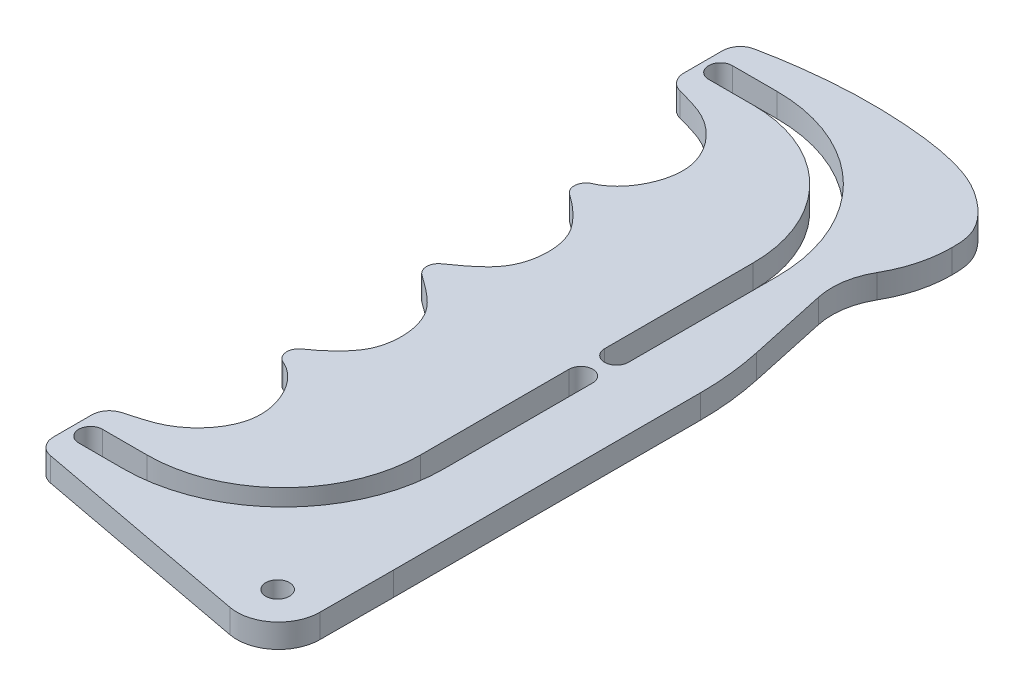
ISO-10303-21;
HEADER;
FILE_DESCRIPTION(('STEP AP214'),'2;1');
FILE_NAME('part.step','',(''),(''),'','','');
FILE_SCHEMA(('AUTOMOTIVE_DESIGN { 1 0 10303 214 1 1 1 1 }'));
ENDSEC;
DATA;
#1=APPLICATION_CONTEXT('core data for automotive mechanical design processes');
#2=APPLICATION_PROTOCOL_DEFINITION('international standard','automotive_design',2000,#1);
#3=PRODUCT_CONTEXT('',#1,'mechanical');
#4=PRODUCT('Part','Part','',(#3));
#5=PRODUCT_RELATED_PRODUCT_CATEGORY('part','',(#4));
#6=PRODUCT_DEFINITION_FORMATION('','',#4);
#7=PRODUCT_DEFINITION_CONTEXT('part definition',#1,'design');
#8=PRODUCT_DEFINITION('design','',#6,#7);
#9=PRODUCT_DEFINITION_SHAPE('','',#8);
#10=(LENGTH_UNIT() NAMED_UNIT(*) SI_UNIT(.MILLI.,.METRE.));
#11=(NAMED_UNIT(*) PLANE_ANGLE_UNIT() SI_UNIT($,.RADIAN.));
#12=(NAMED_UNIT(*) SI_UNIT($,.STERADIAN.) SOLID_ANGLE_UNIT());
#13=UNCERTAINTY_MEASURE_WITH_UNIT(LENGTH_MEASURE(1.E-05),#10,'distance_accuracy_value','');
#14=(GEOMETRIC_REPRESENTATION_CONTEXT(3) GLOBAL_UNCERTAINTY_ASSIGNED_CONTEXT((#13)) GLOBAL_UNIT_ASSIGNED_CONTEXT((#10,
#11,#12)) REPRESENTATION_CONTEXT('',''));
#15=CARTESIAN_POINT('',(0.,0.,0.));
#16=DIRECTION('',(0.,0.,1.));
#17=DIRECTION('',(1.,0.,0.));
#18=AXIS2_PLACEMENT_3D('',#15,#16,#17);
#19=CARTESIAN_POINT('',(0.,2.,-3.));
#20=DIRECTION('',(0.,-1.,0.));
#21=DIRECTION('',(0.,0.,-1.));
#22=AXIS2_PLACEMENT_3D('',#19,#20,#21);
#23=CYLINDRICAL_SURFACE('',#22,2.);
#24=CARTESIAN_POINT('',(0.,-2.,-3.));
#25=DIRECTION('',(0.,1.,0.));
#26=DIRECTION('',(0.,0.,1.));
#27=AXIS2_PLACEMENT_3D('',#24,#25,#26);
#28=CIRCLE('',#27,2.);
#29=CARTESIAN_POINT('',(-2.,-2.,-3.));
#30=VERTEX_POINT('',#29);
#31=CARTESIAN_POINT('',(2.,-2.,-3.));
#32=VERTEX_POINT('',#31);
#33=EDGE_CURVE('E450',#30,#32,#28,.T.);
#34=ORIENTED_EDGE('',*,*,#33,.F.);
#35=DIRECTION('',(0.,-1.,0.));
#36=VECTOR('',#35,1.);
#37=CARTESIAN_POINT('',(-2.,2.,-3.));
#38=LINE('',#37,#36);
#39=CARTESIAN_POINT('',(-2.,2.,-3.));
#40=VERTEX_POINT('',#39);
#41=EDGE_CURVE('E319',#40,#30,#38,.T.);
#42=ORIENTED_EDGE('',*,*,#41,.F.);
#43=CARTESIAN_POINT('',(0.,2.,-3.));
#44=DIRECTION('',(0.,1.,0.));
#45=DIRECTION('',(0.,0.,1.));
#46=AXIS2_PLACEMENT_3D('',#43,#44,#45);
#47=CIRCLE('',#46,2.);
#48=CARTESIAN_POINT('',(2.,2.,-3.));
#49=VERTEX_POINT('',#48);
#50=EDGE_CURVE('E675',#40,#49,#47,.T.);
#51=ORIENTED_EDGE('',*,*,#50,.T.);
#52=DIRECTION('',(0.,-1.,0.));
#53=VECTOR('',#52,1.);
#54=CARTESIAN_POINT('',(2.,2.,-3.));
#55=LINE('',#54,#53);
#56=EDGE_CURVE('E473',#49,#32,#55,.T.);
#57=ORIENTED_EDGE('',*,*,#56,.T.);
#58=EDGE_LOOP('',(#34,#42,#51,#57));
#59=FACE_BOUND('',#58,.T.);
#60=ADVANCED_FACE('F34',(#59),#23,.F.);
#61=CARTESIAN_POINT('',(-2.,2.,0.));
#62=DIRECTION('',(1.,0.,0.));
#63=DIRECTION('',(0.,0.,-1.));
#64=AXIS2_PLACEMENT_3D('',#61,#62,#63);
#65=PLANE('',#64);
#66=DIRECTION('',(0.,0.,1.));
#67=VECTOR('',#66,1.);
#68=CARTESIAN_POINT('',(-2.,-2.,0.));
#69=LINE('',#68,#67);
#70=CARTESIAN_POINT('',(-2.,-2.,-28.));
#71=VERTEX_POINT('',#70);
#72=EDGE_CURVE('E453',#71,#30,#69,.T.);
#73=ORIENTED_EDGE('',*,*,#72,.F.);
#74=DIRECTION('',(0.,-1.,0.));
#75=VECTOR('',#74,1.);
#76=CARTESIAN_POINT('',(-2.,2.,-28.));
#77=LINE('',#76,#75);
#78=CARTESIAN_POINT('',(-2.,2.,-28.));
#79=VERTEX_POINT('',#78);
#80=EDGE_CURVE('E488',#79,#71,#77,.T.);
#81=ORIENTED_EDGE('',*,*,#80,.F.);
#82=DIRECTION('',(0.,0.,1.));
#83=VECTOR('',#82,1.);
#84=CARTESIAN_POINT('',(-2.,2.,0.));
#85=LINE('',#84,#83);
#86=EDGE_CURVE('E678',#79,#40,#85,.T.);
#87=ORIENTED_EDGE('',*,*,#86,.T.);
#88=ORIENTED_EDGE('',*,*,#41,.T.);
#89=EDGE_LOOP('',(#73,#81,#87,#88));
#90=FACE_BOUND('',#89,.T.);
#91=ADVANCED_FACE('F575',(#90),#65,.T.);
#92=CARTESIAN_POINT('',(-25.,2.,-28.));
#93=DIRECTION('',(0.,-1.,0.));
#94=DIRECTION('',(0.,0.,-1.));
#95=AXIS2_PLACEMENT_3D('',#92,#93,#94);
#96=CYLINDRICAL_SURFACE('',#95,23.);
#97=CARTESIAN_POINT('',(-25.,-2.,-28.));
#98=DIRECTION('',(0.,1.,0.));
#99=DIRECTION('',(0.,0.,1.));
#100=AXIS2_PLACEMENT_3D('',#97,#98,#99);
#101=CIRCLE('',#100,23.);
#102=CARTESIAN_POINT('',(-25.,-2.,-51.));
#103=VERTEX_POINT('',#102);
#104=EDGE_CURVE('E456',#103,#71,#101,.F.);
#105=ORIENTED_EDGE('',*,*,#104,.F.);
#106=DIRECTION('',(0.,-1.,0.));
#107=VECTOR('',#106,1.);
#108=CARTESIAN_POINT('',(-25.,2.,-51.));
#109=LINE('',#108,#107);
#110=CARTESIAN_POINT('',(-25.,2.,-51.));
#111=VERTEX_POINT('',#110);
#112=EDGE_CURVE('E486',#111,#103,#109,.T.);
#113=ORIENTED_EDGE('',*,*,#112,.F.);
#114=CARTESIAN_POINT('',(-25.,2.,-28.));
#115=DIRECTION('',(0.,1.,0.));
#116=DIRECTION('',(0.,0.,1.));
#117=AXIS2_PLACEMENT_3D('',#114,#115,#116);
#118=CIRCLE('',#117,23.);
#119=EDGE_CURVE('E681',#111,#79,#118,.F.);
#120=ORIENTED_EDGE('',*,*,#119,.T.);
#121=ORIENTED_EDGE('',*,*,#80,.T.);
#122=EDGE_LOOP('',(#105,#113,#120,#121));
#123=FACE_BOUND('',#122,.T.);
#124=ADVANCED_FACE('F581',(#123),#96,.T.);
#125=CARTESIAN_POINT('',(0.,2.,-51.));
#126=DIRECTION('',(0.,0.,-1.));
#127=DIRECTION('',(-1.,0.,0.));
#128=AXIS2_PLACEMENT_3D('',#125,#126,#127);
#129=PLANE('',#128);
#130=DIRECTION('',(1.,0.,0.));
#131=VECTOR('',#130,1.);
#132=CARTESIAN_POINT('',(0.,-2.,-51.));
#133=LINE('',#132,#131);
#134=CARTESIAN_POINT('',(-32.5,-2.,-51.));
#135=VERTEX_POINT('',#134);
#136=EDGE_CURVE('E459',#135,#103,#133,.T.);
#137=ORIENTED_EDGE('',*,*,#136,.F.);
#138=DIRECTION('',(0.,-1.,0.));
#139=VECTOR('',#138,1.);
#140=CARTESIAN_POINT('',(-32.5,2.,-51.));
#141=LINE('',#140,#139);
#142=CARTESIAN_POINT('',(-32.5,2.,-51.));
#143=VERTEX_POINT('',#142);
#144=EDGE_CURVE('E484',#143,#135,#141,.T.);
#145=ORIENTED_EDGE('',*,*,#144,.F.);
#146=DIRECTION('',(1.,0.,0.));
#147=VECTOR('',#146,1.);
#148=CARTESIAN_POINT('',(0.,2.,-51.));
#149=LINE('',#148,#147);
#150=EDGE_CURVE('E684',#143,#111,#149,.T.);
#151=ORIENTED_EDGE('',*,*,#150,.T.);
#152=ORIENTED_EDGE('',*,*,#112,.T.);
#153=EDGE_LOOP('',(#137,#145,#151,#152));
#154=FACE_BOUND('',#153,.T.);
#155=ADVANCED_FACE('F709',(#154),#129,.T.);
#156=CARTESIAN_POINT('',(-32.5,2.,-53.));
#157=DIRECTION('',(0.,-1.,0.));
#158=DIRECTION('',(0.,0.,-1.));
#159=AXIS2_PLACEMENT_3D('',#156,#157,#158);
#160=CYLINDRICAL_SURFACE('',#159,2.);
#161=CARTESIAN_POINT('',(-32.5,-2.,-53.));
#162=DIRECTION('',(0.,1.,0.));
#163=DIRECTION('',(0.,0.,1.));
#164=AXIS2_PLACEMENT_3D('',#161,#162,#163);
#165=CIRCLE('',#164,2.);
#166=CARTESIAN_POINT('',(-32.5,-2.,-55.));
#167=VERTEX_POINT('',#166);
#168=EDGE_CURVE('E462',#167,#135,#165,.T.);
#169=ORIENTED_EDGE('',*,*,#168,.F.);
#170=DIRECTION('',(0.,-1.,0.));
#171=VECTOR('',#170,1.);
#172=CARTESIAN_POINT('',(-32.5,2.,-55.));
#173=LINE('',#172,#171);
#174=CARTESIAN_POINT('',(-32.5,2.,-55.));
#175=VERTEX_POINT('',#174);
#176=EDGE_CURVE('E482',#175,#167,#173,.T.);
#177=ORIENTED_EDGE('',*,*,#176,.F.);
#178=CARTESIAN_POINT('',(-32.5,2.,-53.));
#179=DIRECTION('',(0.,1.,0.));
#180=DIRECTION('',(0.,0.,1.));
#181=AXIS2_PLACEMENT_3D('',#178,#179,#180);
#182=CIRCLE('',#181,2.);
#183=EDGE_CURVE('E687',#175,#143,#182,.T.);
#184=ORIENTED_EDGE('',*,*,#183,.T.);
#185=ORIENTED_EDGE('',*,*,#144,.T.);
#186=EDGE_LOOP('',(#169,#177,#184,#185));
#187=FACE_BOUND('',#186,.T.);
#188=ADVANCED_FACE('F713',(#187),#160,.F.);
#189=CARTESIAN_POINT('',(0.,2.,-55.));
#190=DIRECTION('',(0.,0.,-1.));
#191=DIRECTION('',(-1.,0.,0.));
#192=AXIS2_PLACEMENT_3D('',#189,#190,#191);
#193=PLANE('',#192);
#194=DIRECTION('',(1.,0.,0.));
#195=VECTOR('',#194,1.);
#196=CARTESIAN_POINT('',(0.,-2.,-55.));
#197=LINE('',#196,#195);
#198=CARTESIAN_POINT('',(-25.,-2.,-55.));
#199=VERTEX_POINT('',#198);
#200=EDGE_CURVE('E465',#167,#199,#197,.T.);
#201=ORIENTED_EDGE('',*,*,#200,.T.);
#202=DIRECTION('',(0.,-1.,0.));
#203=VECTOR('',#202,1.);
#204=CARTESIAN_POINT('',(-25.,2.,-55.));
#205=LINE('',#204,#203);
#206=CARTESIAN_POINT('',(-25.,2.,-55.));
#207=VERTEX_POINT('',#206);
#208=EDGE_CURVE('E479',#207,#199,#205,.T.);
#209=ORIENTED_EDGE('',*,*,#208,.F.);
#210=DIRECTION('',(1.,0.,0.));
#211=VECTOR('',#210,1.);
#212=CARTESIAN_POINT('',(0.,2.,-55.));
#213=LINE('',#212,#211);
#214=EDGE_CURVE('E690',#175,#207,#213,.T.);
#215=ORIENTED_EDGE('',*,*,#214,.F.);
#216=ORIENTED_EDGE('',*,*,#176,.T.);
#217=EDGE_LOOP('',(#201,#209,#215,#216));
#218=FACE_BOUND('',#217,.T.);
#219=ADVANCED_FACE('F718',(#218),#193,.F.);
#220=CARTESIAN_POINT('',(-25.,2.,-28.));
#221=DIRECTION('',(0.,-1.,0.));
#222=DIRECTION('',(0.,0.,-1.));
#223=AXIS2_PLACEMENT_3D('',#220,#221,#222);
#224=CYLINDRICAL_SURFACE('',#223,27.);
#225=CARTESIAN_POINT('',(-25.,-2.,-28.));
#226=DIRECTION('',(0.,1.,0.));
#227=DIRECTION('',(0.,0.,1.));
#228=AXIS2_PLACEMENT_3D('',#225,#226,#227);
#229=CIRCLE('',#228,27.);
#230=CARTESIAN_POINT('',(2.,-2.,-28.));
#231=VERTEX_POINT('',#230);
#232=EDGE_CURVE('E468',#199,#231,#229,.F.);
#233=ORIENTED_EDGE('',*,*,#232,.T.);
#234=DIRECTION('',(0.,-1.,0.));
#235=VECTOR('',#234,1.);
#236=CARTESIAN_POINT('',(2.,2.,-28.));
#237=LINE('',#236,#235);
#238=CARTESIAN_POINT('',(2.,2.,-28.));
#239=VERTEX_POINT('',#238);
#240=EDGE_CURVE('E475',#239,#231,#237,.T.);
#241=ORIENTED_EDGE('',*,*,#240,.F.);
#242=CARTESIAN_POINT('',(-25.,2.,-28.));
#243=DIRECTION('',(0.,1.,0.));
#244=DIRECTION('',(0.,0.,1.));
#245=AXIS2_PLACEMENT_3D('',#242,#243,#244);
#246=CIRCLE('',#245,27.);
#247=EDGE_CURVE('E693',#207,#239,#246,.F.);
#248=ORIENTED_EDGE('',*,*,#247,.F.);
#249=ORIENTED_EDGE('',*,*,#208,.T.);
#250=EDGE_LOOP('',(#233,#241,#248,#249));
#251=FACE_BOUND('',#250,.T.);
#252=ADVANCED_FACE('F620',(#251),#224,.F.);
#253=CARTESIAN_POINT('',(-25.,2.,28.));
#254=DIRECTION('',(0.,-1.,0.));
#255=DIRECTION('',(0.,0.,-1.));
#256=AXIS2_PLACEMENT_3D('',#253,#254,#255);
#257=CYLINDRICAL_SURFACE('',#256,27.);
#258=CARTESIAN_POINT('',(-25.,-2.,28.));
#259=DIRECTION('',(0.,1.,0.));
#260=DIRECTION('',(0.,0.,1.));
#261=AXIS2_PLACEMENT_3D('',#258,#259,#260);
#262=CIRCLE('',#261,27.);
#263=CARTESIAN_POINT('',(-25.,-2.,55.));
#264=VERTEX_POINT('',#263);
#265=CARTESIAN_POINT('',(2.,-2.,28.));
#266=VERTEX_POINT('',#265);
#267=EDGE_CURVE('E426',#264,#266,#262,.T.);
#268=ORIENTED_EDGE('',*,*,#267,.F.);
#269=DIRECTION('',(0.,-1.,0.));
#270=VECTOR('',#269,1.);
#271=CARTESIAN_POINT('',(-25.,2.,55.));
#272=LINE('',#271,#270);
#273=CARTESIAN_POINT('',(-25.,2.,55.));
#274=VERTEX_POINT('',#273);
#275=EDGE_CURVE('E476',#274,#264,#272,.T.);
#276=ORIENTED_EDGE('',*,*,#275,.F.);
#277=CARTESIAN_POINT('',(-25.,2.,28.));
#278=DIRECTION('',(0.,1.,0.));
#279=DIRECTION('',(0.,0.,1.));
#280=AXIS2_PLACEMENT_3D('',#277,#278,#279);
#281=CIRCLE('',#280,27.);
#282=CARTESIAN_POINT('',(2.,2.,28.));
#283=VERTEX_POINT('',#282);
#284=EDGE_CURVE('E652',#274,#283,#281,.T.);
#285=ORIENTED_EDGE('',*,*,#284,.T.);
#286=DIRECTION('',(0.,-1.,0.));
#287=VECTOR('',#286,1.);
#288=CARTESIAN_POINT('',(2.,2.,28.));
#289=LINE('',#288,#287);
#290=EDGE_CURVE('E307',#283,#266,#289,.T.);
#291=ORIENTED_EDGE('',*,*,#290,.T.);
#292=EDGE_LOOP('',(#268,#276,#285,#291));
#293=FACE_BOUND('',#292,.T.);
#294=ADVANCED_FACE('F616',(#293),#257,.F.);
#295=CARTESIAN_POINT('',(0.,2.,55.));
#296=DIRECTION('',(0.,0.,-1.));
#297=DIRECTION('',(-1.,0.,0.));
#298=AXIS2_PLACEMENT_3D('',#295,#296,#297);
#299=PLANE('',#298);
#300=DIRECTION('',(1.,0.,0.));
#301=VECTOR('',#300,1.);
#302=CARTESIAN_POINT('',(0.,-2.,55.));
#303=LINE('',#302,#301);
#304=CARTESIAN_POINT('',(-32.5,-2.,55.));
#305=VERTEX_POINT('',#304);
#306=EDGE_CURVE('E429',#305,#264,#303,.T.);
#307=ORIENTED_EDGE('',*,*,#306,.F.);
#308=DIRECTION('',(0.,-1.,0.));
#309=VECTOR('',#308,1.);
#310=CARTESIAN_POINT('',(-32.5,2.,55.));
#311=LINE('',#310,#309);
#312=CARTESIAN_POINT('',(-32.5,2.,55.));
#313=VERTEX_POINT('',#312);
#314=EDGE_CURVE('E504',#313,#305,#311,.T.);
#315=ORIENTED_EDGE('',*,*,#314,.F.);
#316=DIRECTION('',(1.,0.,0.));
#317=VECTOR('',#316,1.);
#318=CARTESIAN_POINT('',(0.,2.,55.));
#319=LINE('',#318,#317);
#320=EDGE_CURVE('E655',#313,#274,#319,.T.);
#321=ORIENTED_EDGE('',*,*,#320,.T.);
#322=ORIENTED_EDGE('',*,*,#275,.T.);
#323=EDGE_LOOP('',(#307,#315,#321,#322));
#324=FACE_BOUND('',#323,.T.);
#325=ADVANCED_FACE('F612',(#324),#299,.T.);
#326=CARTESIAN_POINT('',(-32.5,2.,53.));
#327=DIRECTION('',(0.,-1.,0.));
#328=DIRECTION('',(0.,0.,-1.));
#329=AXIS2_PLACEMENT_3D('',#326,#327,#328);
#330=CYLINDRICAL_SURFACE('',#329,2.);
#331=CARTESIAN_POINT('',(-32.5,-2.,53.));
#332=DIRECTION('',(0.,1.,0.));
#333=DIRECTION('',(0.,0.,1.));
#334=AXIS2_PLACEMENT_3D('',#331,#332,#333);
#335=CIRCLE('',#334,2.);
#336=CARTESIAN_POINT('',(-32.5,-2.,51.));
#337=VERTEX_POINT('',#336);
#338=EDGE_CURVE('E432',#305,#337,#335,.F.);
#339=ORIENTED_EDGE('',*,*,#338,.T.);
#340=DIRECTION('',(0.,-1.,0.));
#341=VECTOR('',#340,1.);
#342=CARTESIAN_POINT('',(-32.5,2.,51.));
#343=LINE('',#342,#341);
#344=CARTESIAN_POINT('',(-32.5,2.,51.));
#345=VERTEX_POINT('',#344);
#346=EDGE_CURVE('E501',#345,#337,#343,.T.);
#347=ORIENTED_EDGE('',*,*,#346,.F.);
#348=CARTESIAN_POINT('',(-32.5,2.,53.));
#349=DIRECTION('',(0.,1.,0.));
#350=DIRECTION('',(0.,0.,1.));
#351=AXIS2_PLACEMENT_3D('',#348,#349,#350);
#352=CIRCLE('',#351,2.);
#353=EDGE_CURVE('E658',#313,#345,#352,.F.);
#354=ORIENTED_EDGE('',*,*,#353,.F.);
#355=ORIENTED_EDGE('',*,*,#314,.T.);
#356=EDGE_LOOP('',(#339,#347,#354,#355));
#357=FACE_BOUND('',#356,.T.);
#358=ADVANCED_FACE('F608',(#357),#330,.F.);
#359=CARTESIAN_POINT('',(0.,2.,51.));
#360=DIRECTION('',(0.,0.,-1.));
#361=DIRECTION('',(-1.,0.,0.));
#362=AXIS2_PLACEMENT_3D('',#359,#360,#361);
#363=PLANE('',#362);
#364=DIRECTION('',(1.,0.,0.));
#365=VECTOR('',#364,1.);
#366=CARTESIAN_POINT('',(0.,-2.,51.));
#367=LINE('',#366,#365);
#368=CARTESIAN_POINT('',(-25.,-2.,51.));
#369=VERTEX_POINT('',#368);
#370=EDGE_CURVE('E435',#337,#369,#367,.T.);
#371=ORIENTED_EDGE('',*,*,#370,.T.);
#372=DIRECTION('',(0.,-1.,0.));
#373=VECTOR('',#372,1.);
#374=CARTESIAN_POINT('',(-25.,2.,51.));
#375=LINE('',#374,#373);
#376=CARTESIAN_POINT('',(-25.,2.,51.));
#377=VERTEX_POINT('',#376);
#378=EDGE_CURVE('E498',#377,#369,#375,.T.);
#379=ORIENTED_EDGE('',*,*,#378,.F.);
#380=DIRECTION('',(1.,0.,0.));
#381=VECTOR('',#380,1.);
#382=CARTESIAN_POINT('',(0.,2.,51.));
#383=LINE('',#382,#381);
#384=EDGE_CURVE('E661',#345,#377,#383,.T.);
#385=ORIENTED_EDGE('',*,*,#384,.F.);
#386=ORIENTED_EDGE('',*,*,#346,.T.);
#387=EDGE_LOOP('',(#371,#379,#385,#386));
#388=FACE_BOUND('',#387,.T.);
#389=ADVANCED_FACE('F604',(#388),#363,.F.);
#390=CARTESIAN_POINT('',(-25.,2.,28.));
#391=DIRECTION('',(0.,-1.,0.));
#392=DIRECTION('',(0.,0.,-1.));
#393=AXIS2_PLACEMENT_3D('',#390,#391,#392);
#394=CYLINDRICAL_SURFACE('',#393,23.);
#395=CARTESIAN_POINT('',(-25.,-2.,28.));
#396=DIRECTION('',(0.,1.,0.));
#397=DIRECTION('',(0.,0.,1.));
#398=AXIS2_PLACEMENT_3D('',#395,#396,#397);
#399=CIRCLE('',#398,23.);
#400=CARTESIAN_POINT('',(-2.,-2.,28.));
#401=VERTEX_POINT('',#400);
#402=EDGE_CURVE('E438',#369,#401,#399,.T.);
#403=ORIENTED_EDGE('',*,*,#402,.T.);
#404=DIRECTION('',(0.,-1.,0.));
#405=VECTOR('',#404,1.);
#406=CARTESIAN_POINT('',(-2.,2.,28.));
#407=LINE('',#406,#405);
#408=CARTESIAN_POINT('',(-2.,2.,28.));
#409=VERTEX_POINT('',#408);
#410=EDGE_CURVE('E495',#409,#401,#407,.T.);
#411=ORIENTED_EDGE('',*,*,#410,.F.);
#412=CARTESIAN_POINT('',(-25.,2.,28.));
#413=DIRECTION('',(0.,1.,0.));
#414=DIRECTION('',(0.,0.,1.));
#415=AXIS2_PLACEMENT_3D('',#412,#413,#414);
#416=CIRCLE('',#415,23.);
#417=EDGE_CURVE('E664',#377,#409,#416,.T.);
#418=ORIENTED_EDGE('',*,*,#417,.F.);
#419=ORIENTED_EDGE('',*,*,#378,.T.);
#420=EDGE_LOOP('',(#403,#411,#418,#419));
#421=FACE_BOUND('',#420,.T.);
#422=ADVANCED_FACE('F600',(#421),#394,.T.);
#423=CARTESIAN_POINT('',(-2.,2.,0.));
#424=DIRECTION('',(-1.,0.,0.));
#425=DIRECTION('',(0.,0.,1.));
#426=AXIS2_PLACEMENT_3D('',#423,#424,#425);
#427=PLANE('',#426);
#428=DIRECTION('',(0.,0.,-1.));
#429=VECTOR('',#428,1.);
#430=CARTESIAN_POINT('',(-2.,-2.,0.));
#431=LINE('',#430,#429);
#432=CARTESIAN_POINT('',(-2.,-2.,3.));
#433=VERTEX_POINT('',#432);
#434=EDGE_CURVE('E441',#401,#433,#431,.T.);
#435=ORIENTED_EDGE('',*,*,#434,.T.);
#436=DIRECTION('',(0.,-1.,0.));
#437=VECTOR('',#436,1.);
#438=CARTESIAN_POINT('',(-2.,2.,3.));
#439=LINE('',#438,#437);
#440=CARTESIAN_POINT('',(-2.,2.,3.));
#441=VERTEX_POINT('',#440);
#442=EDGE_CURVE('E492',#441,#433,#439,.T.);
#443=ORIENTED_EDGE('',*,*,#442,.F.);
#444=DIRECTION('',(0.,0.,-1.));
#445=VECTOR('',#444,1.);
#446=CARTESIAN_POINT('',(-2.,2.,0.));
#447=LINE('',#446,#445);
#448=EDGE_CURVE('E667',#409,#441,#447,.T.);
#449=ORIENTED_EDGE('',*,*,#448,.F.);
#450=ORIENTED_EDGE('',*,*,#410,.T.);
#451=EDGE_LOOP('',(#435,#443,#449,#450));
#452=FACE_BOUND('',#451,.T.);
#453=ADVANCED_FACE('F596',(#452),#427,.F.);
#454=CARTESIAN_POINT('',(0.,2.,3.));
#455=DIRECTION('',(0.,-1.,0.));
#456=DIRECTION('',(0.,0.,-1.));
#457=AXIS2_PLACEMENT_3D('',#454,#455,#456);
#458=CYLINDRICAL_SURFACE('',#457,2.);
#459=CARTESIAN_POINT('',(0.,-2.,3.));
#460=DIRECTION('',(0.,1.,0.));
#461=DIRECTION('',(0.,0.,1.));
#462=AXIS2_PLACEMENT_3D('',#459,#460,#461);
#463=CIRCLE('',#462,2.);
#464=CARTESIAN_POINT('',(2.,-2.,3.));
#465=VERTEX_POINT('',#464);
#466=EDGE_CURVE('E444',#433,#465,#463,.F.);
#467=ORIENTED_EDGE('',*,*,#466,.T.);
#468=DIRECTION('',(0.,-1.,0.));
#469=VECTOR('',#468,1.);
#470=CARTESIAN_POINT('',(2.,2.,3.));
#471=LINE('',#470,#469);
#472=CARTESIAN_POINT('',(2.,2.,3.));
#473=VERTEX_POINT('',#472);
#474=EDGE_CURVE('E309',#473,#465,#471,.T.);
#475=ORIENTED_EDGE('',*,*,#474,.F.);
#476=CARTESIAN_POINT('',(0.,2.,3.));
#477=DIRECTION('',(0.,1.,0.));
#478=DIRECTION('',(0.,0.,1.));
#479=AXIS2_PLACEMENT_3D('',#476,#477,#478);
#480=CIRCLE('',#479,2.);
#481=EDGE_CURVE('E670',#441,#473,#480,.F.);
#482=ORIENTED_EDGE('',*,*,#481,.F.);
#483=ORIENTED_EDGE('',*,*,#442,.T.);
#484=EDGE_LOOP('',(#467,#475,#482,#483));
#485=FACE_BOUND('',#484,.T.);
#486=ADVANCED_FACE('F593',(#485),#458,.F.);
#487=CARTESIAN_POINT('',(-11.9072006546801,2.,63.1953314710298));
#488=DIRECTION('',(0.185160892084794,0.,-0.982708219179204));
#489=DIRECTION('',(-0.982708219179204,0.,-0.185160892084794));
#490=AXIS2_PLACEMENT_3D('',#487,#488,#489);
#491=PLANE('',#490);
#492=DIRECTION('',(0.982708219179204,0.,0.185160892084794));
#493=VECTOR('',#492,1.);
#494=CARTESIAN_POINT('',(-11.9072006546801,2.,63.1953314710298));
#495=LINE('',#494,#493);
#496=CARTESIAN_POINT('',(-33.0554826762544,2.,59.2105934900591));
#497=VERTEX_POINT('',#496);
#498=CARTESIAN_POINT('',(4.1622015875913,2.,66.223112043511));
#499=VERTEX_POINT('',#498);
#500=EDGE_CURVE('E278',#497,#499,#495,.T.);
#501=ORIENTED_EDGE('',*,*,#500,.F.);
#502=DIRECTION('',(0.,-1.,0.));
#503=VECTOR('',#502,1.);
#504=CARTESIAN_POINT('',(-33.0554826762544,-2.,59.2105934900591));
#505=LINE('',#504,#503);
#506=CARTESIAN_POINT('',(-33.0554826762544,-2.,59.2105934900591));
#507=VERTEX_POINT('',#506);
#508=EDGE_CURVE('E325',#497,#507,#505,.T.);
#509=ORIENTED_EDGE('',*,*,#508,.T.);
#510=DIRECTION('',(0.982708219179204,0.,0.185160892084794));
#511=VECTOR('',#510,1.);
#512=CARTESIAN_POINT('',(-11.9072006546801,-2.,63.1953314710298));
#513=LINE('',#512,#511);
#514=CARTESIAN_POINT('',(4.1622015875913,-2.,66.223112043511));
#515=VERTEX_POINT('',#514);
#516=EDGE_CURVE('E305',#507,#515,#513,.T.);
#517=ORIENTED_EDGE('',*,*,#516,.T.);
#518=DIRECTION('',(0.,-1.,0.));
#519=VECTOR('',#518,1.);
#520=CARTESIAN_POINT('',(4.1622015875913,2.,66.223112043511));
#521=LINE('',#520,#519);
#522=EDGE_CURVE('E298',#499,#515,#521,.T.);
#523=ORIENTED_EDGE('',*,*,#522,.F.);
#524=EDGE_LOOP('',(#501,#509,#517,#523));
#525=FACE_BOUND('',#524,.T.);
#526=ADVANCED_FACE('F303',(#525),#491,.F.);
#527=CARTESIAN_POINT('',(5.45832783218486,2.,59.3441545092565));
#528=DIRECTION('',(0.,-1.,0.));
#529=DIRECTION('',(0.,0.,-1.));
#530=AXIS2_PLACEMENT_3D('',#527,#528,#529);
#531=CYLINDRICAL_SURFACE('',#530,7.);
#532=CARTESIAN_POINT('',(5.45832783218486,-2.,59.3441545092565));
#533=DIRECTION('',(0.,1.,0.));
#534=DIRECTION('',(0.,0.,1.));
#535=AXIS2_PLACEMENT_3D('',#532,#533,#534);
#536=CIRCLE('',#535,7.);
#537=CARTESIAN_POINT('',(12.4582880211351,-2.,59.3677628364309));
#538=VERTEX_POINT('',#537);
#539=EDGE_CURVE('E545',#515,#538,#536,.T.);
#540=ORIENTED_EDGE('',*,*,#539,.T.);
#541=DIRECTION('',(0.,-1.,0.));
#542=VECTOR('',#541,1.);
#543=CARTESIAN_POINT('',(12.4582880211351,2.,59.3677628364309));
#544=LINE('',#543,#542);
#545=CARTESIAN_POINT('',(12.4582880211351,2.,59.3677628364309));
#546=VERTEX_POINT('',#545);
#547=EDGE_CURVE('E299',#546,#538,#544,.T.);
#548=ORIENTED_EDGE('',*,*,#547,.F.);
#549=CARTESIAN_POINT('',(5.45832783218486,2.,59.3441545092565));
#550=DIRECTION('',(0.,1.,0.));
#551=DIRECTION('',(0.,0.,1.));
#552=AXIS2_PLACEMENT_3D('',#549,#550,#551);
#553=CIRCLE('',#552,7.);
#554=EDGE_CURVE('E284',#499,#546,#553,.T.);
#555=ORIENTED_EDGE('',*,*,#554,.F.);
#556=ORIENTED_EDGE('',*,*,#522,.T.);
#557=EDGE_LOOP('',(#540,#548,#555,#556));
#558=FACE_BOUND('',#557,.T.);
#559=ADVANCED_FACE('F297',(#558),#531,.T.);
#560=CARTESIAN_POINT('',(12.6583699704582,2.,0.0426920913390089));
#561=DIRECTION('',(0.999994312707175,0.,0.00337261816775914));
#562=DIRECTION('',(0.00337261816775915,0.,-0.999994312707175));
#563=AXIS2_PLACEMENT_3D('',#560,#561,#562);
#564=PLANE('',#563);
#565=DIRECTION('',(-0.00337261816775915,0.,0.999994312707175));
#566=VECTOR('',#565,1.);
#567=CARTESIAN_POINT('',(12.6583699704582,-2.,0.0426920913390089));
#568=LINE('',#567,#566);
#569=CARTESIAN_POINT('',(12.5,-2.,47.));
#570=VERTEX_POINT('',#569);
#571=EDGE_CURVE('E540',#570,#538,#568,.T.);
#572=ORIENTED_EDGE('',*,*,#571,.F.);
#573=DIRECTION('',(0.,-1.,0.));
#574=VECTOR('',#573,1.);
#575=CARTESIAN_POINT('',(12.5,2.,47.));
#576=LINE('',#575,#574);
#577=CARTESIAN_POINT('',(12.5,2.,47.));
#578=VERTEX_POINT('',#577);
#579=EDGE_CURVE('E311',#578,#570,#576,.T.);
#580=ORIENTED_EDGE('',*,*,#579,.F.);
#581=DIRECTION('',(-0.00337261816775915,0.,0.999994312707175));
#582=VECTOR('',#581,1.);
#583=CARTESIAN_POINT('',(12.6583699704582,2.,0.0426920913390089));
#584=LINE('',#583,#582);
#585=EDGE_CURVE('E301',#578,#546,#584,.T.);
#586=ORIENTED_EDGE('',*,*,#585,.T.);
#587=ORIENTED_EDGE('',*,*,#547,.T.);
#588=EDGE_LOOP('',(#572,#580,#586,#587));
#589=FACE_BOUND('',#588,.T.);
#590=ADVANCED_FACE('F544',(#589),#564,.T.);
#591=CARTESIAN_POINT('',(12.5,2.,0.));
#592=DIRECTION('',(-1.,0.,0.));
#593=DIRECTION('',(0.,0.,1.));
#594=AXIS2_PLACEMENT_3D('',#591,#592,#593);
#595=PLANE('',#594);
#596=DIRECTION('',(0.,0.,-1.));
#597=VECTOR('',#596,1.);
#598=CARTESIAN_POINT('',(12.5,-2.,0.));
#599=LINE('',#598,#597);
#600=CARTESIAN_POINT('',(12.5,-2.,-4.6535863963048));
#601=VERTEX_POINT('',#600);
#602=EDGE_CURVE('E533',#570,#601,#599,.T.);
#603=ORIENTED_EDGE('',*,*,#602,.T.);
#604=DIRECTION('',(0.,-1.,0.));
#605=VECTOR('',#604,1.);
#606=CARTESIAN_POINT('',(12.5,2.,-4.6535863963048));
#607=LINE('',#606,#605);
#608=CARTESIAN_POINT('',(12.5,2.,-4.6535863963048));
#609=VERTEX_POINT('',#608);
#610=EDGE_CURVE('E321',#601,#609,#607,.F.);
#611=ORIENTED_EDGE('',*,*,#610,.T.);
#612=DIRECTION('',(0.,0.,-1.));
#613=VECTOR('',#612,1.);
#614=CARTESIAN_POINT('',(12.5,2.,0.));
#615=LINE('',#614,#613);
#616=EDGE_CURVE('E536',#578,#609,#615,.T.);
#617=ORIENTED_EDGE('',*,*,#616,.F.);
#618=ORIENTED_EDGE('',*,*,#579,.T.);
#619=EDGE_LOOP('',(#603,#611,#617,#618));
#620=FACE_BOUND('',#619,.T.);
#621=ADVANCED_FACE('F532',(#620),#595,.F.);
#622=CARTESIAN_POINT('',(14.0077556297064,2.,-3.03029758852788));
#623=DIRECTION('',(0.977391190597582,0.,-0.21143902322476));
#624=DIRECTION('',(-0.21143902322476,0.,-0.977391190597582));
#625=AXIS2_PLACEMENT_3D('',#622,#623,#624);
#626=PLANE('',#625);
#627=DIRECTION('',(0.21143902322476,0.,0.977391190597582));
#628=VECTOR('',#627,1.);
#629=CARTESIAN_POINT('',(14.0077556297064,2.,-3.03029758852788));
#630=LINE('',#629,#628);
#631=CARTESIAN_POINT('',(8.5,2.,-28.4902706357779));
#632=VERTEX_POINT('',#631);
#633=CARTESIAN_POINT('',(11.3695595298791,2.,-15.2255375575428));
#634=VERTEX_POINT('',#633);
#635=EDGE_CURVE('E1017',#632,#634,#630,.T.);
#636=ORIENTED_EDGE('',*,*,#635,.T.);
#637=DIRECTION('',(0.,-1.,0.));
#638=VECTOR('',#637,1.);
#639=CARTESIAN_POINT('',(11.3695595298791,-2.,-15.2255375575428));
#640=LINE('',#639,#638);
#641=CARTESIAN_POINT('',(11.3695595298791,-2.,-15.2255375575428));
#642=VERTEX_POINT('',#641);
#643=EDGE_CURVE('E315',#634,#642,#640,.T.);
#644=ORIENTED_EDGE('',*,*,#643,.T.);
#645=DIRECTION('',(0.21143902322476,0.,0.977391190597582));
#646=VECTOR('',#645,1.);
#647=CARTESIAN_POINT('',(14.0077556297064,-2.,-3.03029758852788));
#648=LINE('',#647,#646);
#649=CARTESIAN_POINT('',(8.5,-2.,-28.4902706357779));
#650=VERTEX_POINT('',#649);
#651=EDGE_CURVE('E542',#650,#642,#648,.T.);
#652=ORIENTED_EDGE('',*,*,#651,.F.);
#653=DIRECTION('',(0.,-1.,0.));
#654=VECTOR('',#653,1.);
#655=CARTESIAN_POINT('',(8.5,2.,-28.4902706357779));
#656=LINE('',#655,#654);
#657=EDGE_CURVE('E527',#632,#650,#656,.T.);
#658=ORIENTED_EDGE('',*,*,#657,.F.);
#659=EDGE_LOOP('',(#636,#644,#652,#658));
#660=FACE_BOUND('',#659,.T.);
#661=ADVANCED_FACE('F818',(#660),#626,.T.);
#662=CARTESIAN_POINT('',(20.228694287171,2.,-31.027538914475));
#663=DIRECTION('',(0.,-1.,0.));
#664=DIRECTION('',(0.,0.,-1.));
#665=AXIS2_PLACEMENT_3D('',#662,#663,#664);
#666=CYLINDRICAL_SURFACE('',#665,12.);
#667=CARTESIAN_POINT('',(20.228694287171,-2.,-31.027538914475));
#668=DIRECTION('',(0.,1.,0.));
#669=DIRECTION('',(0.,0.,1.));
#670=AXIS2_PLACEMENT_3D('',#667,#668,#669);
#671=CIRCLE('',#670,12.);
#672=CARTESIAN_POINT('',(9.83043392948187,-2.,-37.0172118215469));
#673=VERTEX_POINT('',#672);
#674=EDGE_CURVE('E551',#673,#650,#671,.T.);
#675=ORIENTED_EDGE('',*,*,#674,.F.);
#676=DIRECTION('',(0.,-1.,0.));
#677=VECTOR('',#676,1.);
#678=CARTESIAN_POINT('',(9.83043392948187,2.,-37.0172118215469));
#679=LINE('',#678,#677);
#680=CARTESIAN_POINT('',(9.83043392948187,2.,-37.0172118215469));
#681=VERTEX_POINT('',#680);
#682=EDGE_CURVE('E525',#681,#673,#679,.T.);
#683=ORIENTED_EDGE('',*,*,#682,.F.);
#684=CARTESIAN_POINT('',(20.228694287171,2.,-31.027538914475));
#685=DIRECTION('',(0.,1.,0.));
#686=DIRECTION('',(0.,0.,1.));
#687=AXIS2_PLACEMENT_3D('',#684,#685,#686);
#688=CIRCLE('',#687,12.);
#689=EDGE_CURVE('E1014',#681,#632,#688,.T.);
#690=ORIENTED_EDGE('',*,*,#689,.T.);
#691=ORIENTED_EDGE('',*,*,#657,.T.);
#692=EDGE_LOOP('',(#675,#683,#690,#691));
#693=FACE_BOUND('',#692,.T.);
#694=ADVANCED_FACE('F826',(#693),#666,.F.);
#695=CARTESIAN_POINT('',(-7.5,2.,-47.));
#696=DIRECTION('',(0.,-1.,0.));
#697=DIRECTION('',(0.,0.,-1.));
#698=AXIS2_PLACEMENT_3D('',#695,#696,#697);
#699=CYLINDRICAL_SURFACE('',#698,20.);
#700=CARTESIAN_POINT('',(-7.5,-2.,-47.));
#701=DIRECTION('',(0.,1.,0.));
#702=DIRECTION('',(0.,0.,1.));
#703=AXIS2_PLACEMENT_3D('',#700,#701,#702);
#704=CIRCLE('',#703,20.);
#705=CARTESIAN_POINT('',(12.5,-2.,-47.));
#706=VERTEX_POINT('',#705);
#707=EDGE_CURVE('E554',#706,#673,#704,.F.);
#708=ORIENTED_EDGE('',*,*,#707,.F.);
#709=DIRECTION('',(0.,-1.,0.));
#710=VECTOR('',#709,1.);
#711=CARTESIAN_POINT('',(12.5,2.,-47.));
#712=LINE('',#711,#710);
#713=CARTESIAN_POINT('',(12.5,2.,-47.));
#714=VERTEX_POINT('',#713);
#715=EDGE_CURVE('E523',#714,#706,#712,.T.);
#716=ORIENTED_EDGE('',*,*,#715,.F.);
#717=CARTESIAN_POINT('',(-7.5,2.,-47.));
#718=DIRECTION('',(0.,1.,0.));
#719=DIRECTION('',(0.,0.,1.));
#720=AXIS2_PLACEMENT_3D('',#717,#718,#719);
#721=CIRCLE('',#720,20.);
#722=EDGE_CURVE('E965',#714,#681,#721,.F.);
#723=ORIENTED_EDGE('',*,*,#722,.T.);
#724=ORIENTED_EDGE('',*,*,#682,.T.);
#725=EDGE_LOOP('',(#708,#716,#723,#724));
#726=FACE_BOUND('',#725,.T.);
#727=ADVANCED_FACE('F833',(#726),#699,.T.);
#728=CARTESIAN_POINT('',(12.5,2.,-47.));
#729=CARTESIAN_POINT('',(12.5,2.,-48.4595926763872));
#730=CARTESIAN_POINT('',(12.1330337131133,2.,-52.066302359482));
#731=CARTESIAN_POINT('',(6.96442202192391,2.,-56.953390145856));
#732=CARTESIAN_POINT('',(0.391296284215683,2.,-59.8215146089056));
#733=CARTESIAN_POINT('',(-14.3841914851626,2.,-61.874265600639));
#734=CARTESIAN_POINT('',(-26.5753734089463,2.,-60.7817380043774));
#735=CARTESIAN_POINT('',(-35.5,2.,-58.75));
#736=B_SPLINE_CURVE_WITH_KNOTS('',3,(#728,#729,#730,#731,#732,#733,#734,#735),.UNSPECIFIED.,.F.,
.F.,(4,1,1,1,1,4),(0.,0.0608544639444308,0.194974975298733,0.322298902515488,0.525113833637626,
1.),.UNSPECIFIED.);
#737=DIRECTION('',(0.,-1.,0.));
#738=VECTOR('',#737,1.);
#739=SURFACE_OF_LINEAR_EXTRUSION('',#736,#738);
#740=CARTESIAN_POINT('',(12.5,-2.,-47.));
#741=CARTESIAN_POINT('',(12.5,-2.,-48.4595926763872));
#742=CARTESIAN_POINT('',(12.1330337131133,-2.,-52.066302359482));
#743=CARTESIAN_POINT('',(6.96442202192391,-2.,-56.953390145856));
#744=CARTESIAN_POINT('',(0.391296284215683,-2.,-59.8215146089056));
#745=CARTESIAN_POINT('',(-14.3841914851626,-2.,-61.874265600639));
#746=CARTESIAN_POINT('',(-26.5753734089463,-2.,-60.7817380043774));
#747=CARTESIAN_POINT('',(-35.5,-2.,-58.75));
#748=B_SPLINE_CURVE_WITH_KNOTS('',3,(#740,#741,#742,#743,#744,#745,#746,#747),.UNSPECIFIED.,.F.,
.F.,(4,1,1,1,1,4),(0.,0.0608544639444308,0.194974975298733,0.322298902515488,0.525113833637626,
1.),.UNSPECIFIED.);
#749=CARTESIAN_POINT('',(-33.0981626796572,-2.,-59.2679387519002));
#750=VERTEX_POINT('',#749);
#751=EDGE_CURVE('E384',#706,#750,#748,.T.);
#752=ORIENTED_EDGE('',*,*,#751,.T.);
#753=DIRECTION('',(0.,-1.,0.));
#754=VECTOR('',#753,1.);
#755=CARTESIAN_POINT('',(-33.0981626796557,-2.,-59.2679387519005));
#756=LINE('',#755,#754);
#757=CARTESIAN_POINT('',(-33.0981626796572,2.,-59.2679387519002));
#758=VERTEX_POINT('',#757);
#759=EDGE_CURVE('E11',#750,#758,#756,.F.);
#760=ORIENTED_EDGE('',*,*,#759,.T.);
#761=EDGE_CURVE('E365',#714,#758,#736,.T.);
#762=ORIENTED_EDGE('',*,*,#761,.F.);
#763=ORIENTED_EDGE('',*,*,#715,.T.);
#764=EDGE_LOOP('',(#752,#760,#762,#763));
#765=FACE_BOUND('',#764,.T.);
#766=ADVANCED_FACE('F565',(#765),#739,.F.);
#767=CARTESIAN_POINT('',(-35.5,2.,0.));
#768=DIRECTION('',(1.,0.,0.));
#769=DIRECTION('',(0.,0.,-1.));
#770=AXIS2_PLACEMENT_3D('',#767,#768,#769);
#771=PLANE('',#770);
#772=DIRECTION('',(0.,0.,1.));
#773=VECTOR('',#772,1.);
#774=CARTESIAN_POINT('',(-35.5,-2.,0.));
#775=LINE('',#774,#773);
#776=CARTESIAN_POINT('',(-35.5,-2.,-56.3281766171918));
#777=VERTEX_POINT('',#776);
#778=CARTESIAN_POINT('',(-35.5,-2.,-49.8346210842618));
#779=VERTEX_POINT('',#778);
#780=EDGE_CURVE('E360',#777,#779,#775,.T.);
#781=ORIENTED_EDGE('',*,*,#780,.T.);
#782=DIRECTION('',(0.,-1.,0.));
#783=VECTOR('',#782,1.);
#784=CARTESIAN_POINT('',(-35.5,2.,-49.8346210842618));
#785=LINE('',#784,#783);
#786=CARTESIAN_POINT('',(-35.5,2.,-49.8346210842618));
#787=VERTEX_POINT('',#786);
#788=EDGE_CURVE('E42',#779,#787,#785,.F.);
#789=ORIENTED_EDGE('',*,*,#788,.T.);
#790=DIRECTION('',(0.,0.,1.));
#791=VECTOR('',#790,1.);
#792=CARTESIAN_POINT('',(-35.5,2.,0.));
#793=LINE('',#792,#791);
#794=CARTESIAN_POINT('',(-35.5,2.,-56.3281766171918));
#795=VERTEX_POINT('',#794);
#796=EDGE_CURVE('E357',#795,#787,#793,.T.);
#797=ORIENTED_EDGE('',*,*,#796,.F.);
#798=DIRECTION('',(0.,-1.,0.));
#799=VECTOR('',#798,1.);
#800=CARTESIAN_POINT('',(-35.5,2.,-56.3281766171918));
#801=LINE('',#800,#799);
#802=EDGE_CURVE('E350',#795,#777,#801,.T.);
#803=ORIENTED_EDGE('',*,*,#802,.T.);
#804=EDGE_LOOP('',(#781,#789,#797,#803));
#805=FACE_BOUND('',#804,.T.);
#806=ADVANCED_FACE('F356',(#805),#771,.F.);
#807=CARTESIAN_POINT('',(-35.5,2.,-47.25));
#808=CARTESIAN_POINT('',(-34.3071179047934,2.,-47.25));
#809=CARTESIAN_POINT('',(-31.80546762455,2.,-46.5320161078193));
#810=CARTESIAN_POINT('',(-27.658461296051,2.,-45.3408874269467));
#811=CARTESIAN_POINT('',(-23.5174674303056,2.,-42.141088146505));
#812=CARTESIAN_POINT('',(-20.8192100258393,2.,-36.9422036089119));
#813=CARTESIAN_POINT('',(-22.0818570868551,2.,-29.9076725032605));
#814=CARTESIAN_POINT('',(-25.765807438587,2.,-25.8860325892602));
#815=CARTESIAN_POINT('',(-29.,2.,-25.5));
#816=B_SPLINE_CURVE_WITH_KNOTS('',3,(#807,#808,#809,#810,#811,#812,#813,#814,#815),
.UNSPECIFIED.,.F.,.F.,(4,1,1,1,1,1,4),(0.,0.107470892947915,0.228545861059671,0.385676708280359,
0.563597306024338,0.721103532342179,1.),.UNSPECIFIED.);
#817=DIRECTION('',(0.,-1.,0.));
#818=VECTOR('',#817,1.);
#819=SURFACE_OF_LINEAR_EXTRUSION('',#816,#818);
#820=CARTESIAN_POINT('',(-33.2259644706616,2.,-46.9237834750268));
#821=VERTEX_POINT('',#820);
#822=CARTESIAN_POINT('',(-27.0837669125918,2.,-26.0145453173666));
#823=VERTEX_POINT('',#822);
#824=EDGE_CURVE('E364',#821,#823,#816,.T.);
#825=ORIENTED_EDGE('',*,*,#824,.F.);
#826=DIRECTION('',(0.,-1.,0.));
#827=VECTOR('',#826,1.);
#828=CARTESIAN_POINT('',(-33.2259644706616,2.,-46.9237834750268));
#829=LINE('',#828,#827);
#830=CARTESIAN_POINT('',(-33.2259644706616,-2.,-46.9237834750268));
#831=VERTEX_POINT('',#830);
#832=EDGE_CURVE('E347',#821,#831,#829,.T.);
#833=ORIENTED_EDGE('',*,*,#832,.T.);
#834=CARTESIAN_POINT('',(-35.5,-2.,-47.25));
#835=CARTESIAN_POINT('',(-34.3071179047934,-2.,-47.25));
#836=CARTESIAN_POINT('',(-31.80546762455,-2.,-46.5320161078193));
#837=CARTESIAN_POINT('',(-27.658461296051,-2.,-45.3408874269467));
#838=CARTESIAN_POINT('',(-23.5174674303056,-2.,-42.141088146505));
#839=CARTESIAN_POINT('',(-20.8192100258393,-2.,-36.9422036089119));
#840=CARTESIAN_POINT('',(-22.0818570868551,-2.,-29.9076725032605));
#841=CARTESIAN_POINT('',(-25.765807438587,-2.,-25.8860325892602));
#842=CARTESIAN_POINT('',(-29.,-2.,-25.5));
#843=B_SPLINE_CURVE_WITH_KNOTS('',3,(#834,#835,#836,#837,#838,#839,#840,#841,#842),
.UNSPECIFIED.,.F.,.F.,(4,1,1,1,1,1,4),(0.,0.107470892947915,0.228545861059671,0.385676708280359,
0.563597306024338,0.721103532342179,1.),.UNSPECIFIED.);
#844=CARTESIAN_POINT('',(-27.0837669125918,-2.,-26.0145453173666));
#845=VERTEX_POINT('',#844);
#846=EDGE_CURVE('E373',#831,#845,#843,.T.);
#847=ORIENTED_EDGE('',*,*,#846,.T.);
#848=DIRECTION('',(0.,-1.,0.));
#849=VECTOR('',#848,1.);
#850=CARTESIAN_POINT('',(-27.0837669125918,2.,-26.0145453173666));
#851=LINE('',#850,#849);
#852=EDGE_CURVE('E521',#823,#845,#851,.T.);
#853=ORIENTED_EDGE('',*,*,#852,.F.);
#854=EDGE_LOOP('',(#825,#833,#847,#853));
#855=FACE_BOUND('',#854,.T.);
#856=ADVANCED_FACE('F371',(#855),#819,.F.);
#857=CARTESIAN_POINT('',(-26.2956601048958,2.,-24.1763702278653));
#858=DIRECTION('',(0.,-1.,0.));
#859=DIRECTION('',(0.,0.,-1.));
#860=AXIS2_PLACEMENT_3D('',#857,#858,#859);
#861=CYLINDRICAL_SURFACE('',#860,2.);
#862=CARTESIAN_POINT('',(-26.2956601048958,-2.,-24.1763702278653));
#863=DIRECTION('',(0.,1.,0.));
#864=DIRECTION('',(0.,0.,1.));
#865=AXIS2_PLACEMENT_3D('',#862,#863,#864);
#866=CIRCLE('',#865,2.);
#867=CARTESIAN_POINT('',(-27.4153423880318,-2.,-22.5191703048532));
#868=VERTEX_POINT('',#867);
#869=EDGE_CURVE('E380',#845,#868,#866,.T.);
#870=ORIENTED_EDGE('',*,*,#869,.T.);
#871=DIRECTION('',(0.,-1.,0.));
#872=VECTOR('',#871,1.);
#873=CARTESIAN_POINT('',(-27.4153423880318,2.,-22.5191703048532));
#874=LINE('',#873,#872);
#875=CARTESIAN_POINT('',(-27.4153423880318,2.,-22.5191703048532));
#876=VERTEX_POINT('',#875);
#877=EDGE_CURVE('E518',#876,#868,#874,.T.);
#878=ORIENTED_EDGE('',*,*,#877,.F.);
#879=CARTESIAN_POINT('',(-26.2956601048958,2.,-24.1763702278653));
#880=DIRECTION('',(0.,1.,0.));
#881=DIRECTION('',(0.,0.,1.));
#882=AXIS2_PLACEMENT_3D('',#879,#880,#881);
#883=CIRCLE('',#882,2.);
#884=EDGE_CURVE('E975',#823,#876,#883,.T.);
#885=ORIENTED_EDGE('',*,*,#884,.F.);
#886=ORIENTED_EDGE('',*,*,#852,.T.);
#887=EDGE_LOOP('',(#870,#878,#885,#886));
#888=FACE_BOUND('',#887,.T.);
#889=ADVANCED_FACE('F860',(#888),#861,.T.);
#890=CARTESIAN_POINT('',(-29.,2.,-23.5));
#891=CARTESIAN_POINT('',(-27.2923235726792,2.,-22.5339522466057));
#892=CARTESIAN_POINT('',(-24.630000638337,2.,-20.5558148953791));
#893=CARTESIAN_POINT('',(-21.4799221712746,2.,-16.913631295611));
#894=CARTESIAN_POINT('',(-20.4527694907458,2.,-12.0015635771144));
#895=CARTESIAN_POINT('',(-21.5767925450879,2.,-7.14950226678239));
#896=CARTESIAN_POINT('',(-25.2354928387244,2.,-3.61814026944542));
#897=CARTESIAN_POINT('',(-27.5739154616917,2.,-2.01104338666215));
#898=CARTESIAN_POINT('',(-29.,2.,-1.));
#899=B_SPLINE_CURVE_WITH_KNOTS('',3,(#890,#891,#892,#893,#894,#895,#896,#897,#898),
.UNSPECIFIED.,.F.,.F.,(4,1,1,1,1,1,4),(0.,0.201267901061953,0.344011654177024,0.483271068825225,
0.705793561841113,0.819971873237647,1.),.UNSPECIFIED.);
#900=DIRECTION('',(0.,-1.,0.));
#901=VECTOR('',#900,1.);
#902=SURFACE_OF_LINEAR_EXTRUSION('',#899,#901);
#903=CARTESIAN_POINT('',(-29.,-2.,-23.5));
#904=CARTESIAN_POINT('',(-27.2923235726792,-2.,-22.5339522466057));
#905=CARTESIAN_POINT('',(-24.630000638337,-2.,-20.5558148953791));
#906=CARTESIAN_POINT('',(-21.4799221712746,-2.,-16.913631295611));
#907=CARTESIAN_POINT('',(-20.4527694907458,-2.,-12.0015635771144));
#908=CARTESIAN_POINT('',(-21.5767925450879,-2.,-7.14950226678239));
#909=CARTESIAN_POINT('',(-25.2354928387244,-2.,-3.61814026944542));
#910=CARTESIAN_POINT('',(-27.5739154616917,-2.,-2.01104338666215));
#911=CARTESIAN_POINT('',(-29.,-2.,-1.));
#912=B_SPLINE_CURVE_WITH_KNOTS('',3,(#903,#904,#905,#906,#907,#908,#909,#910,#911),
.UNSPECIFIED.,.F.,.F.,(4,1,1,1,1,1,4),(0.,0.201267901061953,0.344011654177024,0.483271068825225,
0.705793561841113,0.819971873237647,1.),.UNSPECIFIED.);
#913=CARTESIAN_POINT('',(-28.1050819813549,-2.,-1.63267488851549));
#914=VERTEX_POINT('',#913);
#915=EDGE_CURVE('E382',#868,#914,#912,.T.);
#916=ORIENTED_EDGE('',*,*,#915,.T.);
#917=DIRECTION('',(0.,-1.,0.));
#918=VECTOR('',#917,1.);
#919=CARTESIAN_POINT('',(-28.1050819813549,2.,-1.63267488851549));
#920=LINE('',#919,#918);
#921=CARTESIAN_POINT('',(-28.1050819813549,2.,-1.63267488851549));
#922=VERTEX_POINT('',#921);
#923=EDGE_CURVE('E515',#922,#914,#920,.T.);
#924=ORIENTED_EDGE('',*,*,#923,.F.);
#925=EDGE_CURVE('E980',#876,#922,#899,.T.);
#926=ORIENTED_EDGE('',*,*,#925,.F.);
#927=ORIENTED_EDGE('',*,*,#877,.T.);
#928=EDGE_LOOP('',(#916,#924,#926,#927));
#929=FACE_BOUND('',#928,.T.);
#930=ADVANCED_FACE('F867',(#929),#902,.F.);
#931=CARTESIAN_POINT('',(-26.9499314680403,2.,0.));
#932=DIRECTION('',(0.,-1.,0.));
#933=DIRECTION('',(0.,0.,-1.));
#934=AXIS2_PLACEMENT_3D('',#931,#932,#933);
#935=CYLINDRICAL_SURFACE('',#934,2.);
#936=CARTESIAN_POINT('',(-26.9499314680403,-2.,0.));
#937=DIRECTION('',(0.,1.,0.));
#938=DIRECTION('',(0.,0.,1.));
#939=AXIS2_PLACEMENT_3D('',#936,#937,#938);
#940=CIRCLE('',#939,2.);
#941=CARTESIAN_POINT('',(-28.1050819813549,-2.,1.63267488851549));
#942=VERTEX_POINT('',#941);
#943=EDGE_CURVE('E396',#914,#942,#940,.T.);
#944=ORIENTED_EDGE('',*,*,#943,.T.);
#945=DIRECTION('',(0.,-1.,0.));
#946=VECTOR('',#945,1.);
#947=CARTESIAN_POINT('',(-28.1050819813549,2.,1.63267488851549));
#948=LINE('',#947,#946);
#949=CARTESIAN_POINT('',(-28.1050819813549,2.,1.63267488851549));
#950=VERTEX_POINT('',#949);
#951=EDGE_CURVE('E513',#950,#942,#948,.T.);
#952=ORIENTED_EDGE('',*,*,#951,.F.);
#953=CARTESIAN_POINT('',(-26.9499314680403,2.,0.));
#954=DIRECTION('',(0.,1.,0.));
#955=DIRECTION('',(0.,0.,1.));
#956=AXIS2_PLACEMENT_3D('',#953,#954,#955);
#957=CIRCLE('',#956,2.);
#958=EDGE_CURVE('E985',#922,#950,#957,.T.);
#959=ORIENTED_EDGE('',*,*,#958,.F.);
#960=ORIENTED_EDGE('',*,*,#923,.T.);
#961=EDGE_LOOP('',(#944,#952,#959,#960));
#962=FACE_BOUND('',#961,.T.);
#963=ADVANCED_FACE('F875',(#962),#935,.T.);
#964=CARTESIAN_POINT('',(-29.,2.,23.5));
#965=CARTESIAN_POINT('',(-27.2923235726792,2.,22.5339522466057));
#966=CARTESIAN_POINT('',(-24.630000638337,2.,20.5558148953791));
#967=CARTESIAN_POINT('',(-21.4799221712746,2.,16.913631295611));
#968=CARTESIAN_POINT('',(-20.4527694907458,2.,12.0015635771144));
#969=CARTESIAN_POINT('',(-21.5767925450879,2.,7.14950226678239));
#970=CARTESIAN_POINT('',(-25.2354928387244,2.,3.61814026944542));
#971=CARTESIAN_POINT('',(-27.5739154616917,2.,2.01104338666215));
#972=CARTESIAN_POINT('',(-29.,2.,1.));
#973=B_SPLINE_CURVE_WITH_KNOTS('',3,(#964,#965,#966,#967,#968,#969,#970,#971,#972),
.UNSPECIFIED.,.F.,.F.,(4,1,1,1,1,1,4),(0.,0.201267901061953,0.344011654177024,0.483271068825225,
0.705793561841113,0.819971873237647,1.),.UNSPECIFIED.);
#974=DIRECTION('',(0.,-1.,0.));
#975=VECTOR('',#974,1.);
#976=SURFACE_OF_LINEAR_EXTRUSION('',#973,#975);
#977=CARTESIAN_POINT('',(-29.,-2.,23.5));
#978=CARTESIAN_POINT('',(-27.2923235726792,-2.,22.5339522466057));
#979=CARTESIAN_POINT('',(-24.630000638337,-2.,20.5558148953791));
#980=CARTESIAN_POINT('',(-21.4799221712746,-2.,16.913631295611));
#981=CARTESIAN_POINT('',(-20.4527694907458,-2.,12.0015635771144));
#982=CARTESIAN_POINT('',(-21.5767925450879,-2.,7.14950226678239));
#983=CARTESIAN_POINT('',(-25.2354928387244,-2.,3.61814026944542));
#984=CARTESIAN_POINT('',(-27.5739154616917,-2.,2.01104338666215));
#985=CARTESIAN_POINT('',(-29.,-2.,1.));
#986=B_SPLINE_CURVE_WITH_KNOTS('',3,(#977,#978,#979,#980,#981,#982,#983,#984,#985),
.UNSPECIFIED.,.F.,.F.,(4,1,1,1,1,1,4),(0.,0.201267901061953,0.344011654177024,0.483271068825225,
0.705793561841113,0.819971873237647,1.),.UNSPECIFIED.);
#987=CARTESIAN_POINT('',(-27.4153423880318,-2.,22.5191703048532));
#988=VERTEX_POINT('',#987);
#989=EDGE_CURVE('E402',#988,#942,#986,.T.);
#990=ORIENTED_EDGE('',*,*,#989,.F.);
#991=DIRECTION('',(0.,-1.,0.));
#992=VECTOR('',#991,1.);
#993=CARTESIAN_POINT('',(-27.4153423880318,2.,22.5191703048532));
#994=LINE('',#993,#992);
#995=CARTESIAN_POINT('',(-27.4153423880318,2.,22.5191703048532));
#996=VERTEX_POINT('',#995);
#997=EDGE_CURVE('E510',#996,#988,#994,.T.);
#998=ORIENTED_EDGE('',*,*,#997,.F.);
#999=EDGE_CURVE('E989',#996,#950,#973,.T.);
#1000=ORIENTED_EDGE('',*,*,#999,.T.);
#1001=ORIENTED_EDGE('',*,*,#951,.T.);
#1002=EDGE_LOOP('',(#990,#998,#1000,#1001));
#1003=FACE_BOUND('',#1002,.T.);
#1004=ADVANCED_FACE('F883',(#1003),#976,.T.);
#1005=CARTESIAN_POINT('',(-26.2956601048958,2.,24.1763702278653));
#1006=DIRECTION('',(0.,-1.,0.));
#1007=DIRECTION('',(0.,0.,-1.));
#1008=AXIS2_PLACEMENT_3D('',#1005,#1006,#1007);
#1009=CYLINDRICAL_SURFACE('',#1008,2.);
#1010=CARTESIAN_POINT('',(-26.2956601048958,-2.,24.1763702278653));
#1011=DIRECTION('',(0.,1.,0.));
#1012=DIRECTION('',(0.,0.,1.));
#1013=AXIS2_PLACEMENT_3D('',#1010,#1011,#1012);
#1014=CIRCLE('',#1013,2.);
#1015=CARTESIAN_POINT('',(-27.0837669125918,-2.,26.0145453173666));
#1016=VERTEX_POINT('',#1015);
#1017=EDGE_CURVE('E407',#1016,#988,#1014,.F.);
#1018=ORIENTED_EDGE('',*,*,#1017,.F.);
#1019=DIRECTION('',(0.,-1.,0.));
#1020=VECTOR('',#1019,1.);
#1021=CARTESIAN_POINT('',(-27.0837669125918,2.,26.0145453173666));
#1022=LINE('',#1021,#1020);
#1023=CARTESIAN_POINT('',(-27.0837669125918,2.,26.0145453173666));
#1024=VERTEX_POINT('',#1023);
#1025=EDGE_CURVE('E507',#1024,#1016,#1022,.T.);
#1026=ORIENTED_EDGE('',*,*,#1025,.F.);
#1027=CARTESIAN_POINT('',(-26.2956601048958,2.,24.1763702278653));
#1028=DIRECTION('',(0.,1.,0.));
#1029=DIRECTION('',(0.,0.,1.));
#1030=AXIS2_PLACEMENT_3D('',#1027,#1028,#1029);
#1031=CIRCLE('',#1030,2.);
#1032=EDGE_CURVE('E642',#1024,#996,#1031,.F.);
#1033=ORIENTED_EDGE('',*,*,#1032,.T.);
#1034=ORIENTED_EDGE('',*,*,#997,.T.);
#1035=EDGE_LOOP('',(#1018,#1026,#1033,#1034));
#1036=FACE_BOUND('',#1035,.T.);
#1037=ADVANCED_FACE('F633',(#1036),#1009,.T.);
#1038=CARTESIAN_POINT('',(-35.5,2.,47.25));
#1039=CARTESIAN_POINT('',(-34.3071179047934,2.,47.25));
#1040=CARTESIAN_POINT('',(-31.80546762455,2.,46.5320161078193));
#1041=CARTESIAN_POINT('',(-27.658461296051,2.,45.3408874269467));
#1042=CARTESIAN_POINT('',(-23.5174674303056,2.,42.141088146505));
#1043=CARTESIAN_POINT('',(-20.8192100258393,2.,36.9422036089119));
#1044=CARTESIAN_POINT('',(-22.0818570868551,2.,29.9076725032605));
#1045=CARTESIAN_POINT('',(-25.765807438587,2.,25.8860325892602));
#1046=CARTESIAN_POINT('',(-29.,2.,25.5));
#1047=B_SPLINE_CURVE_WITH_KNOTS('',3,(#1038,#1039,#1040,#1041,#1042,#1043,#1044,#1045,#1046),
.UNSPECIFIED.,.F.,.F.,(4,1,1,1,1,1,4),(0.,0.107470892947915,0.228545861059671,0.385676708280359,
0.563597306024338,0.721103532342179,1.),.UNSPECIFIED.);
#1048=DIRECTION('',(0.,-1.,0.));
#1049=VECTOR('',#1048,1.);
#1050=SURFACE_OF_LINEAR_EXTRUSION('',#1047,#1049);
#1051=CARTESIAN_POINT('',(-35.5,-2.,47.25));
#1052=CARTESIAN_POINT('',(-34.3071179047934,-2.,47.25));
#1053=CARTESIAN_POINT('',(-31.80546762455,-2.,46.5320161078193));
#1054=CARTESIAN_POINT('',(-27.658461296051,-2.,45.3408874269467));
#1055=CARTESIAN_POINT('',(-23.5174674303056,-2.,42.141088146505));
#1056=CARTESIAN_POINT('',(-20.8192100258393,-2.,36.9422036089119));
#1057=CARTESIAN_POINT('',(-22.0818570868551,-2.,29.9076725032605));
#1058=CARTESIAN_POINT('',(-25.765807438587,-2.,25.8860325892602));
#1059=CARTESIAN_POINT('',(-29.,-2.,25.5));
#1060=B_SPLINE_CURVE_WITH_KNOTS('',3,(#1051,#1052,#1053,#1054,#1055,#1056,#1057,#1058,#1059),
.UNSPECIFIED.,.F.,.F.,(4,1,1,1,1,1,4),(0.,0.107470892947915,0.228545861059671,0.385676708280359,
0.563597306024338,0.721103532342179,1.),.UNSPECIFIED.);
#1061=CARTESIAN_POINT('',(-33.2259644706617,-2.,46.9237834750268));
#1062=VERTEX_POINT('',#1061);
#1063=EDGE_CURVE('E413',#1062,#1016,#1060,.T.);
#1064=ORIENTED_EDGE('',*,*,#1063,.F.);
#1065=DIRECTION('',(0.,-1.,0.));
#1066=VECTOR('',#1065,1.);
#1067=CARTESIAN_POINT('',(-33.2259644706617,-2.,46.9237834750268));
#1068=LINE('',#1067,#1066);
#1069=CARTESIAN_POINT('',(-33.2259644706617,2.,46.9237834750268));
#1070=VERTEX_POINT('',#1069);
#1071=EDGE_CURVE('E49',#1062,#1070,#1068,.F.);
#1072=ORIENTED_EDGE('',*,*,#1071,.T.);
#1073=EDGE_CURVE('E635',#1070,#1024,#1047,.T.);
#1074=ORIENTED_EDGE('',*,*,#1073,.T.);
#1075=ORIENTED_EDGE('',*,*,#1025,.T.);
#1076=EDGE_LOOP('',(#1064,#1072,#1074,#1075));
#1077=FACE_BOUND('',#1076,.T.);
#1078=ADVANCED_FACE('F591',(#1077),#1050,.T.);
#1079=CARTESIAN_POINT('',(2.,2.,0.));
#1080=DIRECTION('',(-1.,0.,0.));
#1081=DIRECTION('',(0.,0.,1.));
#1082=AXIS2_PLACEMENT_3D('',#1079,#1080,#1081);
#1083=PLANE('',#1082);
#1084=DIRECTION('',(0.,0.,-1.));
#1085=VECTOR('',#1084,1.);
#1086=CARTESIAN_POINT('',(2.,-2.,0.));
#1087=LINE('',#1086,#1085);
#1088=EDGE_CURVE('E447',#266,#465,#1087,.T.);
#1089=ORIENTED_EDGE('',*,*,#1088,.F.);
#1090=ORIENTED_EDGE('',*,*,#290,.F.);
#1091=DIRECTION('',(0.,0.,-1.));
#1092=VECTOR('',#1091,1.);
#1093=CARTESIAN_POINT('',(2.,2.,0.));
#1094=LINE('',#1093,#1092);
#1095=EDGE_CURVE('E672',#283,#473,#1094,.T.);
#1096=ORIENTED_EDGE('',*,*,#1095,.T.);
#1097=ORIENTED_EDGE('',*,*,#474,.T.);
#1098=EDGE_LOOP('',(#1089,#1090,#1096,#1097));
#1099=FACE_BOUND('',#1098,.T.);
#1100=ADVANCED_FACE('F587',(#1099),#1083,.T.);
#1101=CARTESIAN_POINT('',(5.58276338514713,2.,59.6110074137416));
#1102=DIRECTION('',(0.,-1.,0.));
#1103=DIRECTION('',(0.,0.,-1.));
#1104=AXIS2_PLACEMENT_3D('',#1101,#1102,#1103);
#1105=CYLINDRICAL_SURFACE('',#1104,2.);
#1106=CARTESIAN_POINT('',(5.58276338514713,2.,59.6110074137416));
#1107=DIRECTION('',(0.,1.,0.));
#1108=DIRECTION('',(0.,0.,1.));
#1109=AXIS2_PLACEMENT_3D('',#1106,#1107,#1108);
#1110=CIRCLE('',#1109,2.);
#1111=CARTESIAN_POINT('',(5.58276338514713,2.,61.6110074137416));
#1112=VERTEX_POINT('',#1111);
#1113=EDGE_CURVE('E649',#1112,#1112,#1110,.T.);
#1114=ORIENTED_EDGE('',*,*,#1113,.T.);
#1115=EDGE_LOOP('',(#1114));
#1116=FACE_BOUND('',#1115,.T.);
#1117=CARTESIAN_POINT('',(5.58276338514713,-2.,59.6110074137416));
#1118=DIRECTION('',(0.,1.,0.));
#1119=DIRECTION('',(0.,0.,1.));
#1120=AXIS2_PLACEMENT_3D('',#1117,#1118,#1119);
#1121=CIRCLE('',#1120,2.);
#1122=CARTESIAN_POINT('',(5.58276338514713,-2.,61.6110074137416));
#1123=VERTEX_POINT('',#1122);
#1124=EDGE_CURVE('E423',#1123,#1123,#1121,.T.);
#1125=ORIENTED_EDGE('',*,*,#1124,.F.);
#1126=EDGE_LOOP('',(#1125));
#1127=FACE_BOUND('',#1126,.T.);
#1128=ADVANCED_FACE('F590',(#1116,#1127),#1105,.F.);
#1129=CARTESIAN_POINT('',(-35.5,2.,0.));
#1130=DIRECTION('',(-1.,0.,0.));
#1131=DIRECTION('',(0.,0.,1.));
#1132=AXIS2_PLACEMENT_3D('',#1129,#1130,#1131);
#1133=PLANE('',#1132);
#1134=DIRECTION('',(0.,0.,-1.));
#1135=VECTOR('',#1134,1.);
#1136=CARTESIAN_POINT('',(-35.5,-2.,0.));
#1137=LINE('',#1136,#1135);
#1138=CARTESIAN_POINT('',(-35.5,-2.,56.2624688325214));
#1139=VERTEX_POINT('',#1138);
#1140=CARTESIAN_POINT('',(-35.5,-2.,49.8346210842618));
#1141=VERTEX_POINT('',#1140);
#1142=EDGE_CURVE('E417',#1139,#1141,#1137,.T.);
#1143=ORIENTED_EDGE('',*,*,#1142,.F.);
#1144=DIRECTION('',(0.,-1.,0.));
#1145=VECTOR('',#1144,1.);
#1146=CARTESIAN_POINT('',(-35.5,2.,56.2624688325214));
#1147=LINE('',#1146,#1145);
#1148=CARTESIAN_POINT('',(-35.5,2.,56.2624688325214));
#1149=VERTEX_POINT('',#1148);
#1150=EDGE_CURVE('E338',#1139,#1149,#1147,.F.);
#1151=ORIENTED_EDGE('',*,*,#1150,.T.);
#1152=DIRECTION('',(0.,0.,-1.));
#1153=VECTOR('',#1152,1.);
#1154=CARTESIAN_POINT('',(-35.5,2.,0.));
#1155=LINE('',#1154,#1153);
#1156=CARTESIAN_POINT('',(-35.5,2.,49.8346210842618));
#1157=VERTEX_POINT('',#1156);
#1158=EDGE_CURVE('E641',#1149,#1157,#1155,.T.);
#1159=ORIENTED_EDGE('',*,*,#1158,.T.);
#1160=DIRECTION('',(0.,-1.,0.));
#1161=VECTOR('',#1160,1.);
#1162=CARTESIAN_POINT('',(-35.5,2.,49.8346210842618));
#1163=LINE('',#1162,#1161);
#1164=EDGE_CURVE('E335',#1157,#1141,#1163,.T.);
#1165=ORIENTED_EDGE('',*,*,#1164,.T.);
#1166=EDGE_LOOP('',(#1143,#1151,#1159,#1165));
#1167=FACE_BOUND('',#1166,.T.);
#1168=ADVANCED_FACE('F624',(#1167),#1133,.T.);
#1169=CARTESIAN_POINT('',(2.,2.,0.));
#1170=DIRECTION('',(1.,0.,0.));
#1171=DIRECTION('',(0.,0.,-1.));
#1172=AXIS2_PLACEMENT_3D('',#1169,#1170,#1171);
#1173=PLANE('',#1172);
#1174=DIRECTION('',(0.,0.,1.));
#1175=VECTOR('',#1174,1.);
#1176=CARTESIAN_POINT('',(2.,-2.,0.));
#1177=LINE('',#1176,#1175);
#1178=EDGE_CURVE('E292',#231,#32,#1177,.T.);
#1179=ORIENTED_EDGE('',*,*,#1178,.T.);
#1180=ORIENTED_EDGE('',*,*,#56,.F.);
#1181=DIRECTION('',(0.,0.,1.));
#1182=VECTOR('',#1181,1.);
#1183=CARTESIAN_POINT('',(2.,2.,0.));
#1184=LINE('',#1183,#1182);
#1185=EDGE_CURVE('E511',#239,#49,#1184,.T.);
#1186=ORIENTED_EDGE('',*,*,#1185,.F.);
#1187=ORIENTED_EDGE('',*,*,#240,.T.);
#1188=EDGE_LOOP('',(#1179,#1180,#1186,#1187));
#1189=FACE_BOUND('',#1188,.T.);
#1190=ADVANCED_FACE('F628',(#1189),#1173,.F.);
#1191=CARTESIAN_POINT('',(0.,2.,0.));
#1192=DIRECTION('',(0.,1.,0.));
#1193=DIRECTION('',(0.,0.,1.));
#1194=AXIS2_PLACEMENT_3D('',#1191,#1192,#1193);
#1195=PLANE('',#1194);
#1196=ORIENTED_EDGE('',*,*,#1158,.F.);
#1197=CARTESIAN_POINT('',(-32.5,2.,56.2624688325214));
#1198=DIRECTION('',(0.,1.,0.));
#1199=DIRECTION('',(0.,0.,1.));
#1200=AXIS2_PLACEMENT_3D('',#1197,#1198,#1199);
#1201=CIRCLE('',#1200,3.);
#1202=EDGE_CURVE('E287',#1149,#497,#1201,.T.);
#1203=ORIENTED_EDGE('',*,*,#1202,.T.);
#1204=ORIENTED_EDGE('',*,*,#500,.T.);
#1205=ORIENTED_EDGE('',*,*,#554,.T.);
#1206=ORIENTED_EDGE('',*,*,#585,.F.);
#1207=ORIENTED_EDGE('',*,*,#616,.T.);
#1208=CARTESIAN_POINT('',(-37.5,2.,-4.6535863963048));
#1209=DIRECTION('',(0.,1.,0.));
#1210=DIRECTION('',(0.,0.,1.));
#1211=AXIS2_PLACEMENT_3D('',#1208,#1209,#1210);
#1212=CIRCLE('',#1211,50.);
#1213=EDGE_CURVE('E323',#609,#634,#1212,.T.);
#1214=ORIENTED_EDGE('',*,*,#1213,.T.);
#1215=ORIENTED_EDGE('',*,*,#635,.F.);
#1216=ORIENTED_EDGE('',*,*,#689,.F.);
#1217=ORIENTED_EDGE('',*,*,#722,.F.);
#1218=ORIENTED_EDGE('',*,*,#761,.T.);
#1219=CARTESIAN_POINT('',(-32.5,2.,-56.3281766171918));
#1220=DIRECTION('',(0.,1.,0.));
#1221=DIRECTION('',(0.,0.,1.));
#1222=AXIS2_PLACEMENT_3D('',#1219,#1220,#1221);
#1223=CIRCLE('',#1222,3.);
#1224=EDGE_CURVE('E340',#758,#795,#1223,.T.);
#1225=ORIENTED_EDGE('',*,*,#1224,.T.);
#1226=ORIENTED_EDGE('',*,*,#796,.T.);
#1227=CARTESIAN_POINT('',(-32.5000000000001,2.,-49.8346210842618));
#1228=DIRECTION('',(0.,1.,0.));
#1229=DIRECTION('',(0.,0.,1.));
#1230=AXIS2_PLACEMENT_3D('',#1227,#1228,#1229);
#1231=CIRCLE('',#1230,3.);
#1232=EDGE_CURVE('E57',#787,#821,#1231,.T.);
#1233=ORIENTED_EDGE('',*,*,#1232,.T.);
#1234=ORIENTED_EDGE('',*,*,#824,.T.);
#1235=ORIENTED_EDGE('',*,*,#884,.T.);
#1236=ORIENTED_EDGE('',*,*,#925,.T.);
#1237=ORIENTED_EDGE('',*,*,#958,.T.);
#1238=ORIENTED_EDGE('',*,*,#999,.F.);
#1239=ORIENTED_EDGE('',*,*,#1032,.F.);
#1240=ORIENTED_EDGE('',*,*,#1073,.F.);
#1241=CARTESIAN_POINT('',(-32.5000000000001,2.,49.8346210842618));
#1242=DIRECTION('',(0.,1.,0.));
#1243=DIRECTION('',(0.,0.,1.));
#1244=AXIS2_PLACEMENT_3D('',#1241,#1242,#1243);
#1245=CIRCLE('',#1244,3.);
#1246=EDGE_CURVE('E343',#1070,#1157,#1245,.T.);
#1247=ORIENTED_EDGE('',*,*,#1246,.T.);
#1248=EDGE_LOOP('',(#1196,#1203,#1204,#1205,#1206,#1207,#1214,#1215,#1216,#1217,#1218,#1225,
#1226,#1233,#1234,#1235,#1236,#1237,#1238,#1239,#1240,#1247));
#1249=FACE_BOUND('',#1248,.T.);
#1250=ORIENTED_EDGE('',*,*,#1113,.F.);
#1251=EDGE_LOOP('',(#1250));
#1252=FACE_BOUND('',#1251,.T.);
#1253=ORIENTED_EDGE('',*,*,#284,.F.);
#1254=ORIENTED_EDGE('',*,*,#320,.F.);
#1255=ORIENTED_EDGE('',*,*,#353,.T.);
#1256=ORIENTED_EDGE('',*,*,#384,.T.);
#1257=ORIENTED_EDGE('',*,*,#417,.T.);
#1258=ORIENTED_EDGE('',*,*,#448,.T.);
#1259=ORIENTED_EDGE('',*,*,#481,.T.);
#1260=ORIENTED_EDGE('',*,*,#1095,.F.);
#1261=EDGE_LOOP('',(#1253,#1254,#1255,#1256,#1257,#1258,#1259,#1260));
#1262=FACE_BOUND('',#1261,.T.);
#1263=ORIENTED_EDGE('',*,*,#50,.F.);
#1264=ORIENTED_EDGE('',*,*,#86,.F.);
#1265=ORIENTED_EDGE('',*,*,#119,.F.);
#1266=ORIENTED_EDGE('',*,*,#150,.F.);
#1267=ORIENTED_EDGE('',*,*,#183,.F.);
#1268=ORIENTED_EDGE('',*,*,#214,.T.);
#1269=ORIENTED_EDGE('',*,*,#247,.T.);
#1270=ORIENTED_EDGE('',*,*,#1185,.T.);
#1271=EDGE_LOOP('',(#1263,#1264,#1265,#1266,#1267,#1268,#1269,#1270));
#1272=FACE_BOUND('',#1271,.T.);
#1273=ADVANCED_FACE('F281',(#1249,#1252,#1262,#1272),#1195,.T.);
#1274=CARTESIAN_POINT('',(0.,-2.,0.));
#1275=DIRECTION('',(0.,1.,0.));
#1276=DIRECTION('',(0.,0.,1.));
#1277=AXIS2_PLACEMENT_3D('',#1274,#1275,#1276);
#1278=PLANE('',#1277);
#1279=ORIENTED_EDGE('',*,*,#516,.F.);
#1280=CARTESIAN_POINT('',(-32.5,-2.,56.2624688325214));
#1281=DIRECTION('',(0.,1.,0.));
#1282=DIRECTION('',(0.,0.,1.));
#1283=AXIS2_PLACEMENT_3D('',#1280,#1281,#1282);
#1284=CIRCLE('',#1283,3.);
#1285=EDGE_CURVE('E333',#507,#1139,#1284,.F.);
#1286=ORIENTED_EDGE('',*,*,#1285,.T.);
#1287=ORIENTED_EDGE('',*,*,#1142,.T.);
#1288=CARTESIAN_POINT('',(-32.5000000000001,-2.,49.8346210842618));
#1289=DIRECTION('',(0.,1.,0.));
#1290=DIRECTION('',(0.,0.,1.));
#1291=AXIS2_PLACEMENT_3D('',#1288,#1289,#1290);
#1292=CIRCLE('',#1291,3.);
#1293=EDGE_CURVE('E331',#1141,#1062,#1292,.F.);
#1294=ORIENTED_EDGE('',*,*,#1293,.T.);
#1295=ORIENTED_EDGE('',*,*,#1063,.T.);
#1296=ORIENTED_EDGE('',*,*,#1017,.T.);
#1297=ORIENTED_EDGE('',*,*,#989,.T.);
#1298=ORIENTED_EDGE('',*,*,#943,.F.);
#1299=ORIENTED_EDGE('',*,*,#915,.F.);
#1300=ORIENTED_EDGE('',*,*,#869,.F.);
#1301=ORIENTED_EDGE('',*,*,#846,.F.);
#1302=CARTESIAN_POINT('',(-32.5000000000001,-2.,-49.8346210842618));
#1303=DIRECTION('',(0.,1.,0.));
#1304=DIRECTION('',(0.,0.,1.));
#1305=AXIS2_PLACEMENT_3D('',#1302,#1303,#1304);
#1306=CIRCLE('',#1305,3.);
#1307=EDGE_CURVE('E329',#831,#779,#1306,.F.);
#1308=ORIENTED_EDGE('',*,*,#1307,.T.);
#1309=ORIENTED_EDGE('',*,*,#780,.F.);
#1310=CARTESIAN_POINT('',(-32.5,-2.,-56.3281766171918));
#1311=DIRECTION('',(0.,1.,0.));
#1312=DIRECTION('',(0.,0.,1.));
#1313=AXIS2_PLACEMENT_3D('',#1310,#1311,#1312);
#1314=CIRCLE('',#1313,3.);
#1315=EDGE_CURVE('E327',#777,#750,#1314,.F.);
#1316=ORIENTED_EDGE('',*,*,#1315,.T.);
#1317=ORIENTED_EDGE('',*,*,#751,.F.);
#1318=ORIENTED_EDGE('',*,*,#707,.T.);
#1319=ORIENTED_EDGE('',*,*,#674,.T.);
#1320=ORIENTED_EDGE('',*,*,#651,.T.);
#1321=CARTESIAN_POINT('',(-37.5,-2.,-4.6535863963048));
#1322=DIRECTION('',(0.,1.,0.));
#1323=DIRECTION('',(0.,0.,1.));
#1324=AXIS2_PLACEMENT_3D('',#1321,#1322,#1323);
#1325=CIRCLE('',#1324,50.);
#1326=EDGE_CURVE('E318',#642,#601,#1325,.F.);
#1327=ORIENTED_EDGE('',*,*,#1326,.T.);
#1328=ORIENTED_EDGE('',*,*,#602,.F.);
#1329=ORIENTED_EDGE('',*,*,#571,.T.);
#1330=ORIENTED_EDGE('',*,*,#539,.F.);
#1331=EDGE_LOOP('',(#1279,#1286,#1287,#1294,#1295,#1296,#1297,#1298,#1299,#1300,#1301,#1308,
#1309,#1316,#1317,#1318,#1319,#1320,#1327,#1328,#1329,#1330));
#1332=FACE_BOUND('',#1331,.T.);
#1333=ORIENTED_EDGE('',*,*,#1124,.T.);
#1334=EDGE_LOOP('',(#1333));
#1335=FACE_BOUND('',#1334,.T.);
#1336=ORIENTED_EDGE('',*,*,#267,.T.);
#1337=ORIENTED_EDGE('',*,*,#1088,.T.);
#1338=ORIENTED_EDGE('',*,*,#466,.F.);
#1339=ORIENTED_EDGE('',*,*,#434,.F.);
#1340=ORIENTED_EDGE('',*,*,#402,.F.);
#1341=ORIENTED_EDGE('',*,*,#370,.F.);
#1342=ORIENTED_EDGE('',*,*,#338,.F.);
#1343=ORIENTED_EDGE('',*,*,#306,.T.);
#1344=EDGE_LOOP('',(#1336,#1337,#1338,#1339,#1340,#1341,#1342,#1343));
#1345=FACE_BOUND('',#1344,.T.);
#1346=ORIENTED_EDGE('',*,*,#33,.T.);
#1347=ORIENTED_EDGE('',*,*,#1178,.F.);
#1348=ORIENTED_EDGE('',*,*,#232,.F.);
#1349=ORIENTED_EDGE('',*,*,#200,.F.);
#1350=ORIENTED_EDGE('',*,*,#168,.T.);
#1351=ORIENTED_EDGE('',*,*,#136,.T.);
#1352=ORIENTED_EDGE('',*,*,#104,.T.);
#1353=ORIENTED_EDGE('',*,*,#72,.T.);
#1354=EDGE_LOOP('',(#1346,#1347,#1348,#1349,#1350,#1351,#1352,#1353));
#1355=FACE_BOUND('',#1354,.T.);
#1356=ADVANCED_FACE('F377',(#1332,#1335,#1345,#1355),#1278,.F.);
#1357=CARTESIAN_POINT('',(-37.5,2.,-4.6535863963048));
#1358=DIRECTION('',(0.,1.,0.));
#1359=DIRECTION('',(0.,0.,1.));
#1360=AXIS2_PLACEMENT_3D('',#1357,#1358,#1359);
#1361=CYLINDRICAL_SURFACE('',#1360,50.);
#1362=ORIENTED_EDGE('',*,*,#1213,.F.);
#1363=ORIENTED_EDGE('',*,*,#610,.F.);
#1364=ORIENTED_EDGE('',*,*,#1326,.F.);
#1365=ORIENTED_EDGE('',*,*,#643,.F.);
#1366=EDGE_LOOP('',(#1362,#1363,#1364,#1365));
#1367=FACE_BOUND('',#1366,.T.);
#1368=ADVANCED_FACE('F722',(#1367),#1361,.T.);
#1369=CARTESIAN_POINT('',(-32.5,2.,56.2624688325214));
#1370=DIRECTION('',(0.,1.,0.));
#1371=DIRECTION('',(0.,0.,1.));
#1372=AXIS2_PLACEMENT_3D('',#1369,#1370,#1371);
#1373=CYLINDRICAL_SURFACE('',#1372,3.);
#1374=ORIENTED_EDGE('',*,*,#1202,.F.);
#1375=ORIENTED_EDGE('',*,*,#1150,.F.);
#1376=ORIENTED_EDGE('',*,*,#1285,.F.);
#1377=ORIENTED_EDGE('',*,*,#508,.F.);
#1378=EDGE_LOOP('',(#1374,#1375,#1376,#1377));
#1379=FACE_BOUND('',#1378,.T.);
#1380=ADVANCED_FACE('F728',(#1379),#1373,.T.);
#1381=CARTESIAN_POINT('',(-32.5000000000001,0.,49.8346210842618));
#1382=DIRECTION('',(0.,-1.,0.));
#1383=DIRECTION('',(0.,0.,-1.));
#1384=AXIS2_PLACEMENT_3D('',#1381,#1382,#1383);
#1385=CYLINDRICAL_SURFACE('',#1384,3.);
#1386=ORIENTED_EDGE('',*,*,#1246,.F.);
#1387=ORIENTED_EDGE('',*,*,#1071,.F.);
#1388=ORIENTED_EDGE('',*,*,#1293,.F.);
#1389=ORIENTED_EDGE('',*,*,#1164,.F.);
#1390=EDGE_LOOP('',(#1386,#1387,#1388,#1389));
#1391=FACE_BOUND('',#1390,.T.);
#1392=ADVANCED_FACE('F573',(#1391),#1385,.T.);
#1393=CARTESIAN_POINT('',(-32.5000000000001,0.,-49.8346210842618));
#1394=DIRECTION('',(0.,-1.,0.));
#1395=DIRECTION('',(0.,0.,-1.));
#1396=AXIS2_PLACEMENT_3D('',#1393,#1394,#1395);
#1397=CYLINDRICAL_SURFACE('',#1396,3.);
#1398=ORIENTED_EDGE('',*,*,#1232,.F.);
#1399=ORIENTED_EDGE('',*,*,#788,.F.);
#1400=ORIENTED_EDGE('',*,*,#1307,.F.);
#1401=ORIENTED_EDGE('',*,*,#832,.F.);
#1402=EDGE_LOOP('',(#1398,#1399,#1400,#1401));
#1403=FACE_BOUND('',#1402,.T.);
#1404=ADVANCED_FACE('F368',(#1403),#1397,.T.);
#1405=CARTESIAN_POINT('',(-32.5,0.,-56.3281766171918));
#1406=DIRECTION('',(0.,-1.,0.));
#1407=DIRECTION('',(0.,0.,-1.));
#1408=AXIS2_PLACEMENT_3D('',#1405,#1406,#1407);
#1409=CYLINDRICAL_SURFACE('',#1408,3.);
#1410=ORIENTED_EDGE('',*,*,#1224,.F.);
#1411=ORIENTED_EDGE('',*,*,#759,.F.);
#1412=ORIENTED_EDGE('',*,*,#1315,.F.);
#1413=ORIENTED_EDGE('',*,*,#802,.F.);
#1414=EDGE_LOOP('',(#1410,#1411,#1412,#1413));
#1415=FACE_BOUND('',#1414,.T.);
#1416=ADVANCED_FACE('F36',(#1415),#1409,.T.);
#1417=CLOSED_SHELL('',(#60,#91,#124,#155,#188,#219,#252,#294,#325,#358,#389,#422,#453,#486,#526,
#559,#590,#621,#661,#694,#727,#766,#806,#856,#889,#930,#963,#1004,#1037,#1078,#1100,#1128,#1168,
#1190,#1273,#1356,#1368,#1380,#1392,#1404,#1416));
#1418=MANIFOLD_SOLID_BREP('B2',#1417);
#1419=ADVANCED_BREP_SHAPE_REPRESENTATION('',(#18,#1418),#14);
#1420=SHAPE_DEFINITION_REPRESENTATION(#9,#1419);
ENDSEC;
END-ISO-10303-21;
